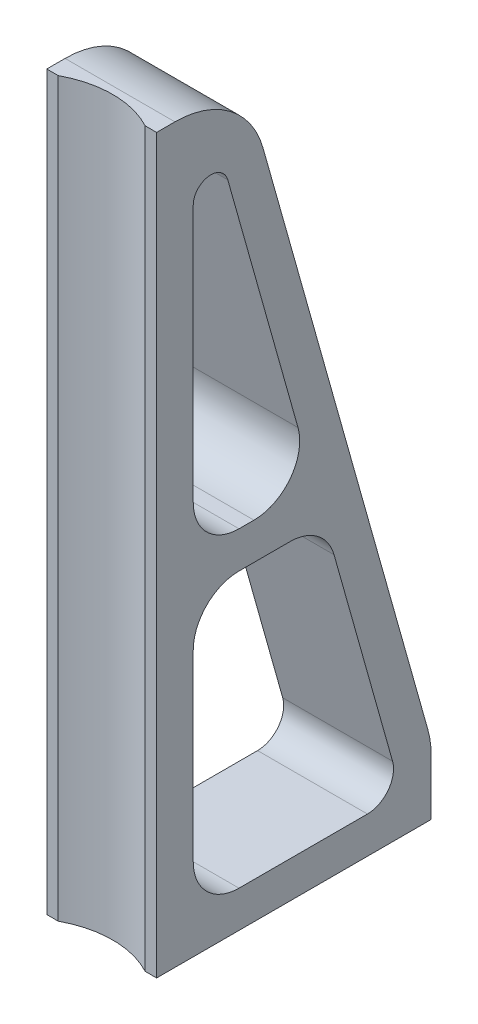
ISO-10303-21;
HEADER;
FILE_DESCRIPTION(('STEP AP214'),'2;1');
FILE_NAME('part.step','',(''),(''),'','','');
FILE_SCHEMA(('AUTOMOTIVE_DESIGN { 1 0 10303 214 1 1 1 1 }'));
ENDSEC;
DATA;
#1=APPLICATION_CONTEXT('core data for automotive mechanical design processes');
#2=APPLICATION_PROTOCOL_DEFINITION('international standard','automotive_design',2000,#1);
#3=PRODUCT_CONTEXT('',#1,'mechanical');
#4=PRODUCT('Part','Part','',(#3));
#5=PRODUCT_RELATED_PRODUCT_CATEGORY('part','',(#4));
#6=PRODUCT_DEFINITION_FORMATION('','',#4);
#7=PRODUCT_DEFINITION_CONTEXT('part definition',#1,'design');
#8=PRODUCT_DEFINITION('design','',#6,#7);
#9=PRODUCT_DEFINITION_SHAPE('','',#8);
#10=(LENGTH_UNIT() NAMED_UNIT(*) SI_UNIT(.MILLI.,.METRE.));
#11=(NAMED_UNIT(*) PLANE_ANGLE_UNIT() SI_UNIT($,.RADIAN.));
#12=(NAMED_UNIT(*) SI_UNIT($,.STERADIAN.) SOLID_ANGLE_UNIT());
#13=UNCERTAINTY_MEASURE_WITH_UNIT(LENGTH_MEASURE(1.E-05),#10,'distance_accuracy_value','');
#14=(GEOMETRIC_REPRESENTATION_CONTEXT(3) GLOBAL_UNCERTAINTY_ASSIGNED_CONTEXT((#13)) GLOBAL_UNIT_ASSIGNED_CONTEXT((#10,
#11,#12)) REPRESENTATION_CONTEXT('',''));
#15=CARTESIAN_POINT('',(0.,0.,0.));
#16=DIRECTION('',(0.,0.,1.));
#17=DIRECTION('',(1.,0.,0.));
#18=AXIS2_PLACEMENT_3D('',#15,#16,#17);
#19=CARTESIAN_POINT('',(3.81,0.,0.));
#20=DIRECTION('',(0.,0.,-1.));
#21=DIRECTION('',(-1.,0.,0.));
#22=AXIS2_PLACEMENT_3D('',#19,#20,#21);
#23=PLANE('',#22);
#24=DIRECTION('',(-1.,0.,0.));
#25=VECTOR('',#24,1.);
#26=CARTESIAN_POINT('',(3.81,0.,0.));
#27=LINE('',#26,#25);
#28=CARTESIAN_POINT('',(-3.01608289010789,0.,0.));
#29=VERTEX_POINT('',#28);
#30=CARTESIAN_POINT('',(-3.81,0.,0.));
#31=VERTEX_POINT('',#30);
#32=EDGE_CURVE('E275',#29,#31,#27,.T.);
#33=ORIENTED_EDGE('',*,*,#32,.F.);
#34=DIRECTION('',(0.,1.,0.));
#35=VECTOR('',#34,1.);
#36=CARTESIAN_POINT('',(-3.01608289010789,0.,0.));
#37=LINE('',#36,#35);
#38=CARTESIAN_POINT('',(-3.01608289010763,50.8,0.));
#39=VERTEX_POINT('',#38);
#40=EDGE_CURVE('E316',#29,#39,#37,.T.);
#41=ORIENTED_EDGE('',*,*,#40,.T.);
#42=DIRECTION('',(-1.,0.,0.));
#43=VECTOR('',#42,1.);
#44=CARTESIAN_POINT('',(3.81,50.8,0.));
#45=LINE('',#44,#43);
#46=CARTESIAN_POINT('',(-3.81,50.8,0.));
#47=VERTEX_POINT('',#46);
#48=EDGE_CURVE('E294',#39,#47,#45,.T.);
#49=ORIENTED_EDGE('',*,*,#48,.T.);
#50=DIRECTION('',(0.,-1.,0.));
#51=VECTOR('',#50,1.);
#52=CARTESIAN_POINT('',(-3.81,0.,0.));
#53=LINE('',#52,#51);
#54=EDGE_CURVE('E263',#47,#31,#53,.T.);
#55=ORIENTED_EDGE('',*,*,#54,.T.);
#56=EDGE_LOOP('',(#33,#41,#49,#55));
#57=FACE_BOUND('',#56,.T.);
#58=ADVANCED_FACE('F33',(#57),#23,.F.);
#59=CARTESIAN_POINT('',(3.81,0.,-19.05));
#60=DIRECTION('',(0.,1.,0.));
#61=DIRECTION('',(0.,0.,1.));
#62=AXIS2_PLACEMENT_3D('',#59,#60,#61);
#63=PLANE('',#62);
#64=CARTESIAN_POINT('',(3.81,0.,0.));
#65=VERTEX_POINT('',#64);
#66=CARTESIAN_POINT('',(3.01608289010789,0.,0.));
#67=VERTEX_POINT('',#66);
#68=EDGE_CURVE('E291',#65,#67,#27,.T.);
#69=ORIENTED_EDGE('',*,*,#68,.T.);
#70=CARTESIAN_POINT('',(0.,0.,5.58799999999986));
#71=DIRECTION('',(0.,1.,0.));
#72=DIRECTION('',(0.,0.,1.));
#73=AXIS2_PLACEMENT_3D('',#70,#71,#72);
#74=CIRCLE('',#73,6.35);
#75=EDGE_CURVE('E254',#67,#29,#74,.T.);
#76=ORIENTED_EDGE('',*,*,#75,.T.);
#77=ORIENTED_EDGE('',*,*,#32,.T.);
#78=DIRECTION('',(0.,0.,-1.));
#79=VECTOR('',#78,1.);
#80=CARTESIAN_POINT('',(-3.81,0.,-19.05));
#81=LINE('',#80,#79);
#82=CARTESIAN_POINT('',(-3.81,0.,-19.05));
#83=VERTEX_POINT('',#82);
#84=EDGE_CURVE('E257',#31,#83,#81,.T.);
#85=ORIENTED_EDGE('',*,*,#84,.T.);
#86=DIRECTION('',(-1.,0.,0.));
#87=VECTOR('',#86,1.);
#88=CARTESIAN_POINT('',(3.81,0.,-19.05));
#89=LINE('',#88,#87);
#90=CARTESIAN_POINT('',(3.81,0.,-19.05));
#91=VERTEX_POINT('',#90);
#92=EDGE_CURVE('E310',#91,#83,#89,.T.);
#93=ORIENTED_EDGE('',*,*,#92,.F.);
#94=DIRECTION('',(0.,0.,-1.));
#95=VECTOR('',#94,1.);
#96=CARTESIAN_POINT('',(3.81,0.,-19.05));
#97=LINE('',#96,#95);
#98=EDGE_CURVE('E259',#65,#91,#97,.T.);
#99=ORIENTED_EDGE('',*,*,#98,.F.);
#100=EDGE_LOOP('',(#69,#76,#77,#85,#93,#99));
#101=FACE_BOUND('',#100,.T.);
#102=ADVANCED_FACE('F374',(#101),#63,.F.);
#103=CARTESIAN_POINT('',(3.81,3.81,-19.05));
#104=DIRECTION('',(0.,0.,1.));
#105=DIRECTION('',(1.,0.,0.));
#106=AXIS2_PLACEMENT_3D('',#103,#104,#105);
#107=PLANE('',#106);
#108=DIRECTION('',(0.,1.,0.));
#109=VECTOR('',#108,1.);
#110=CARTESIAN_POINT('',(-3.81,3.81,-19.05));
#111=LINE('',#110,#109);
#112=CARTESIAN_POINT('',(-3.81,3.81,-19.05));
#113=VERTEX_POINT('',#112);
#114=EDGE_CURVE('E278',#83,#113,#111,.T.);
#115=ORIENTED_EDGE('',*,*,#114,.T.);
#116=DIRECTION('',(-1.,0.,0.));
#117=VECTOR('',#116,1.);
#118=CARTESIAN_POINT('',(3.81,3.81,-19.05));
#119=LINE('',#118,#117);
#120=CARTESIAN_POINT('',(3.81,3.81,-19.05));
#121=VERTEX_POINT('',#120);
#122=EDGE_CURVE('E307',#121,#113,#119,.T.);
#123=ORIENTED_EDGE('',*,*,#122,.F.);
#124=DIRECTION('',(0.,1.,0.));
#125=VECTOR('',#124,1.);
#126=CARTESIAN_POINT('',(3.81,3.81,-19.05));
#127=LINE('',#126,#125);
#128=EDGE_CURVE('E262',#91,#121,#127,.T.);
#129=ORIENTED_EDGE('',*,*,#128,.F.);
#130=ORIENTED_EDGE('',*,*,#92,.T.);
#131=EDGE_LOOP('',(#115,#123,#129,#130));
#132=FACE_BOUND('',#131,.T.);
#133=ADVANCED_FACE('F381',(#132),#107,.F.);
#134=CARTESIAN_POINT('',(3.81,3.81,-12.7));
#135=DIRECTION('',(-1.,0.,0.));
#136=DIRECTION('',(0.,0.,1.));
#137=AXIS2_PLACEMENT_3D('',#134,#135,#136);
#138=CYLINDRICAL_SURFACE('',#137,6.35);
#139=CARTESIAN_POINT('',(-3.81,3.81,-12.7));
#140=DIRECTION('',(1.,0.,0.));
#141=DIRECTION('',(0.,0.,-1.));
#142=AXIS2_PLACEMENT_3D('',#139,#140,#141);
#143=CIRCLE('',#142,6.35);
#144=CARTESIAN_POINT('',(-3.81,5.5292344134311,-18.8128334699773));
#145=VERTEX_POINT('',#144);
#146=EDGE_CURVE('E280',#113,#145,#143,.T.);
#147=ORIENTED_EDGE('',*,*,#146,.T.);
#148=DIRECTION('',(-1.,0.,0.));
#149=VECTOR('',#148,1.);
#150=CARTESIAN_POINT('',(3.81,5.5292344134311,-18.8128334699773));
#151=LINE('',#150,#149);
#152=CARTESIAN_POINT('',(3.81,5.5292344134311,-18.8128334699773));
#153=VERTEX_POINT('',#152);
#154=EDGE_CURVE('E304',#153,#145,#151,.T.);
#155=ORIENTED_EDGE('',*,*,#154,.F.);
#156=CARTESIAN_POINT('',(3.81,3.81,-12.7));
#157=DIRECTION('',(1.,0.,0.));
#158=DIRECTION('',(0.,0.,-1.));
#159=AXIS2_PLACEMENT_3D('',#156,#157,#158);
#160=CIRCLE('',#159,6.35);
#161=EDGE_CURVE('E265',#121,#153,#160,.T.);
#162=ORIENTED_EDGE('',*,*,#161,.F.);
#163=ORIENTED_EDGE('',*,*,#122,.T.);
#164=EDGE_LOOP('',(#147,#155,#162,#163));
#165=FACE_BOUND('',#164,.T.);
#166=ADVANCED_FACE('F425',(#165),#138,.T.);
#167=CARTESIAN_POINT('',(3.81,46.1692344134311,-7.38283346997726));
#168=DIRECTION('',(0.,-0.270745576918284,0.962650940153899));
#169=DIRECTION('',(0.,-0.962650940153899,-0.270745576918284));
#170=AXIS2_PLACEMENT_3D('',#167,#168,#169);
#171=PLANE('',#170);
#172=DIRECTION('',(0.,0.962650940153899,0.270745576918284));
#173=VECTOR('',#172,1.);
#174=CARTESIAN_POINT('',(-3.81,46.1692344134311,-7.38283346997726));
#175=LINE('',#174,#173);
#176=CARTESIAN_POINT('',(-3.81,46.1692344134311,-7.38283346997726));
#177=VERTEX_POINT('',#176);
#178=EDGE_CURVE('E282',#145,#177,#175,.T.);
#179=ORIENTED_EDGE('',*,*,#178,.T.);
#180=DIRECTION('',(-1.,0.,0.));
#181=VECTOR('',#180,1.);
#182=CARTESIAN_POINT('',(3.81,46.1692344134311,-7.38283346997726));
#183=LINE('',#182,#181);
#184=CARTESIAN_POINT('',(3.81,46.1692344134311,-7.38283346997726));
#185=VERTEX_POINT('',#184);
#186=EDGE_CURVE('E301',#185,#177,#183,.T.);
#187=ORIENTED_EDGE('',*,*,#186,.F.);
#188=DIRECTION('',(0.,0.962650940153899,0.270745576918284));
#189=VECTOR('',#188,1.);
#190=CARTESIAN_POINT('',(3.81,46.1692344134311,-7.38283346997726));
#191=LINE('',#190,#189);
#192=EDGE_CURVE('E267',#153,#185,#191,.T.);
#193=ORIENTED_EDGE('',*,*,#192,.F.);
#194=ORIENTED_EDGE('',*,*,#154,.T.);
#195=EDGE_LOOP('',(#179,#187,#193,#194));
#196=FACE_BOUND('',#195,.T.);
#197=ADVANCED_FACE('F427',(#196),#171,.F.);
#198=CARTESIAN_POINT('',(3.81,44.45,-1.27));
#199=DIRECTION('',(-1.,0.,0.));
#200=DIRECTION('',(0.,0.,1.));
#201=AXIS2_PLACEMENT_3D('',#198,#199,#200);
#202=CYLINDRICAL_SURFACE('',#201,6.35);
#203=CARTESIAN_POINT('',(-3.81,44.45,-1.27));
#204=DIRECTION('',(1.,0.,0.));
#205=DIRECTION('',(0.,0.,1.));
#206=AXIS2_PLACEMENT_3D('',#203,#204,#205);
#207=CIRCLE('',#206,6.35);
#208=CARTESIAN_POINT('',(-3.81,50.8,-1.27));
#209=VERTEX_POINT('',#208);
#210=EDGE_CURVE('E284',#177,#209,#207,.T.);
#211=ORIENTED_EDGE('',*,*,#210,.T.);
#212=DIRECTION('',(-1.,0.,0.));
#213=VECTOR('',#212,1.);
#214=CARTESIAN_POINT('',(3.81,50.8,-1.27));
#215=LINE('',#214,#213);
#216=CARTESIAN_POINT('',(3.81,50.8,-1.27));
#217=VERTEX_POINT('',#216);
#218=EDGE_CURVE('E298',#217,#209,#215,.T.);
#219=ORIENTED_EDGE('',*,*,#218,.F.);
#220=CARTESIAN_POINT('',(3.81,44.45,-1.27));
#221=DIRECTION('',(1.,0.,0.));
#222=DIRECTION('',(0.,0.,1.));
#223=AXIS2_PLACEMENT_3D('',#220,#221,#222);
#224=CIRCLE('',#223,6.35);
#225=EDGE_CURVE('E269',#185,#217,#224,.T.);
#226=ORIENTED_EDGE('',*,*,#225,.F.);
#227=ORIENTED_EDGE('',*,*,#186,.T.);
#228=EDGE_LOOP('',(#211,#219,#226,#227));
#229=FACE_BOUND('',#228,.T.);
#230=ADVANCED_FACE('F395',(#229),#202,.T.);
#231=CARTESIAN_POINT('',(3.81,50.8,0.));
#232=DIRECTION('',(0.,-1.,0.));
#233=DIRECTION('',(0.,0.,-1.));
#234=AXIS2_PLACEMENT_3D('',#231,#232,#233);
#235=PLANE('',#234);
#236=ORIENTED_EDGE('',*,*,#48,.F.);
#237=CARTESIAN_POINT('',(0.,50.8,5.588));
#238=DIRECTION('',(0.,1.,0.));
#239=DIRECTION('',(0.,0.,1.));
#240=AXIS2_PLACEMENT_3D('',#237,#238,#239);
#241=CIRCLE('',#240,6.35);
#242=CARTESIAN_POINT('',(3.01608289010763,50.8,0.));
#243=VERTEX_POINT('',#242);
#244=EDGE_CURVE('E251',#243,#39,#241,.T.);
#245=ORIENTED_EDGE('',*,*,#244,.F.);
#246=CARTESIAN_POINT('',(3.81,50.8,0.));
#247=VERTEX_POINT('',#246);
#248=EDGE_CURVE('E295',#247,#243,#45,.T.);
#249=ORIENTED_EDGE('',*,*,#248,.F.);
#250=DIRECTION('',(0.,0.,1.));
#251=VECTOR('',#250,1.);
#252=CARTESIAN_POINT('',(3.81,50.8,0.));
#253=LINE('',#252,#251);
#254=EDGE_CURVE('E271',#217,#247,#253,.T.);
#255=ORIENTED_EDGE('',*,*,#254,.F.);
#256=ORIENTED_EDGE('',*,*,#218,.T.);
#257=DIRECTION('',(0.,0.,1.));
#258=VECTOR('',#257,1.);
#259=CARTESIAN_POINT('',(-3.81,50.8,0.));
#260=LINE('',#259,#258);
#261=EDGE_CURVE('E286',#209,#47,#260,.T.);
#262=ORIENTED_EDGE('',*,*,#261,.T.);
#263=EDGE_LOOP('',(#236,#245,#249,#255,#256,#262));
#264=FACE_BOUND('',#263,.T.);
#265=ADVANCED_FACE('F388',(#264),#235,.F.);
#266=ORIENTED_EDGE('',*,*,#248,.T.);
#267=DIRECTION('',(0.,1.,0.));
#268=VECTOR('',#267,1.);
#269=CARTESIAN_POINT('',(3.01608289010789,0.,0.));
#270=LINE('',#269,#268);
#271=EDGE_CURVE('E313',#243,#67,#270,.F.);
#272=ORIENTED_EDGE('',*,*,#271,.T.);
#273=ORIENTED_EDGE('',*,*,#68,.F.);
#274=DIRECTION('',(0.,-1.,0.));
#275=VECTOR('',#274,1.);
#276=CARTESIAN_POINT('',(3.81,0.,0.));
#277=LINE('',#276,#275);
#278=EDGE_CURVE('E273',#247,#65,#277,.T.);
#279=ORIENTED_EDGE('',*,*,#278,.F.);
#280=EDGE_LOOP('',(#266,#272,#273,#279));
#281=FACE_BOUND('',#280,.T.);
#282=ADVANCED_FACE('F377',(#281),#23,.F.);
#283=CARTESIAN_POINT('',(3.81,44.45,-1.27));
#284=DIRECTION('',(-1.,0.,0.));
#285=DIRECTION('',(0.,0.,1.));
#286=AXIS2_PLACEMENT_3D('',#283,#284,#285);
#287=PLANE('',#286);
#288=DIRECTION('',(0.,-1.,0.));
#289=VECTOR('',#288,1.);
#290=CARTESIAN_POINT('',(3.81,21.59,-2.54));
#291=LINE('',#290,#289);
#292=CARTESIAN_POINT('',(3.81,18.415,-2.54));
#293=VERTEX_POINT('',#292);
#294=CARTESIAN_POINT('',(3.81,5.71500000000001,-2.54));
#295=VERTEX_POINT('',#294);
#296=EDGE_CURVE('E215',#293,#295,#291,.T.);
#297=ORIENTED_EDGE('',*,*,#296,.F.);
#298=CARTESIAN_POINT('',(3.81,18.415,-5.715));
#299=DIRECTION('',(-1.,0.,0.));
#300=DIRECTION('',(0.,0.,1.));
#301=AXIS2_PLACEMENT_3D('',#298,#299,#300);
#302=CIRCLE('',#301,3.175);
#303=CARTESIAN_POINT('',(3.81,21.59,-5.715));
#304=VERTEX_POINT('',#303);
#305=EDGE_CURVE('E347',#293,#304,#302,.T.);
#306=ORIENTED_EDGE('',*,*,#305,.T.);
#307=DIRECTION('',(0.,0.,1.));
#308=VECTOR('',#307,1.);
#309=CARTESIAN_POINT('',(3.81,21.59,-2.54));
#310=LINE('',#309,#308);
#311=CARTESIAN_POINT('',(3.81,21.59,-9.25198056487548));
#312=VERTEX_POINT('',#311);
#313=EDGE_CURVE('E212',#312,#304,#310,.T.);
#314=ORIENTED_EDGE('',*,*,#313,.F.);
#315=CARTESIAN_POINT('',(3.81,18.415,-9.25198056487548));
#316=DIRECTION('',(-1.,0.,0.));
#317=DIRECTION('',(0.,0.,1.));
#318=AXIS2_PLACEMENT_3D('',#315,#316,#317);
#319=CIRCLE('',#318,3.175);
#320=CARTESIAN_POINT('',(3.81,19.2746172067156,-12.3083972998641));
#321=VERTEX_POINT('',#320);
#322=EDGE_CURVE('E343',#312,#321,#319,.T.);
#323=ORIENTED_EDGE('',*,*,#322,.T.);
#324=DIRECTION('',(0.,0.962650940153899,0.270745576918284));
#325=VECTOR('',#324,1.);
#326=CARTESIAN_POINT('',(3.81,4.84154064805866,-16.3677000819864));
#327=LINE('',#326,#325);
#328=CARTESIAN_POINT('',(3.81,4.84154064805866,-16.3677000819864));
#329=VERTEX_POINT('',#328);
#330=EDGE_CURVE('E221',#329,#321,#327,.T.);
#331=ORIENTED_EDGE('',*,*,#330,.F.);
#332=CARTESIAN_POINT('',(3.81,4.35117344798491,-14.6241722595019));
#333=DIRECTION('',(1.,0.,0.));
#334=DIRECTION('',(0.,0.,-1.));
#335=AXIS2_PLACEMENT_3D('',#332,#333,#334);
#336=CIRCLE('',#335,1.81117344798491);
#337=CARTESIAN_POINT('',(3.81,2.54,-14.6241722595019));
#338=VERTEX_POINT('',#337);
#339=EDGE_CURVE('E219',#338,#329,#336,.T.);
#340=ORIENTED_EDGE('',*,*,#339,.F.);
#341=DIRECTION('',(0.,0.,-1.));
#342=VECTOR('',#341,1.);
#343=CARTESIAN_POINT('',(3.81,2.54,-2.54));
#344=LINE('',#343,#342);
#345=CARTESIAN_POINT('',(3.81,2.54,-5.715));
#346=VERTEX_POINT('',#345);
#347=EDGE_CURVE('E199',#346,#338,#344,.T.);
#348=ORIENTED_EDGE('',*,*,#347,.F.);
#349=CARTESIAN_POINT('',(3.81,5.715,-5.715));
#350=DIRECTION('',(-1.,0.,0.));
#351=DIRECTION('',(0.,0.,1.));
#352=AXIS2_PLACEMENT_3D('',#349,#350,#351);
#353=CIRCLE('',#352,3.175);
#354=EDGE_CURVE('E41',#346,#295,#353,.T.);
#355=ORIENTED_EDGE('',*,*,#354,.T.);
#356=EDGE_LOOP('',(#297,#306,#314,#323,#331,#340,#348,#355));
#357=FACE_BOUND('',#356,.T.);
#358=DIRECTION('',(0.,0.,-1.));
#359=VECTOR('',#358,1.);
#360=CARTESIAN_POINT('',(3.81,24.13,-2.54));
#361=LINE('',#360,#359);
#362=CARTESIAN_POINT('',(3.81,24.13,-5.715));
#363=VERTEX_POINT('',#362);
#364=CARTESIAN_POINT('',(3.81,24.13,-6.75166806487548));
#365=VERTEX_POINT('',#364);
#366=EDGE_CURVE('E242',#363,#365,#361,.T.);
#367=ORIENTED_EDGE('',*,*,#366,.F.);
#368=CARTESIAN_POINT('',(3.81,27.305,-5.715));
#369=DIRECTION('',(-1.,0.,0.));
#370=DIRECTION('',(0.,0.,1.));
#371=AXIS2_PLACEMENT_3D('',#368,#369,#370);
#372=CIRCLE('',#371,3.175);
#373=CARTESIAN_POINT('',(3.81,27.305,-2.54));
#374=VERTEX_POINT('',#373);
#375=EDGE_CURVE('E355',#363,#374,#372,.T.);
#376=ORIENTED_EDGE('',*,*,#375,.T.);
#377=DIRECTION('',(0.,-1.,0.));
#378=VECTOR('',#377,1.);
#379=CARTESIAN_POINT('',(3.81,45.1507805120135,-2.54));
#380=LINE('',#379,#378);
#381=CARTESIAN_POINT('',(3.81,45.1507805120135,-2.54));
#382=VERTEX_POINT('',#381);
#383=EDGE_CURVE('E225',#382,#374,#380,.T.);
#384=ORIENTED_EDGE('',*,*,#383,.F.);
#385=CARTESIAN_POINT('',(3.81,45.1507805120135,-3.76166404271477));
#386=DIRECTION('',(1.,0.,0.));
#387=DIRECTION('',(0.,0.,-1.));
#388=AXIS2_PLACEMENT_3D('',#385,#386,#387);
#389=CIRCLE('',#388,1.22166404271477);
#390=CARTESIAN_POINT('',(3.81,45.4815406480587,-4.93770008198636));
#391=VERTEX_POINT('',#390);
#392=EDGE_CURVE('E231',#391,#382,#389,.T.);
#393=ORIENTED_EDGE('',*,*,#392,.F.);
#394=DIRECTION('',(0.,0.962650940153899,0.270745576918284));
#395=VECTOR('',#394,1.);
#396=CARTESIAN_POINT('',(3.81,24.13,-10.9428208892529));
#397=LINE('',#396,#395);
#398=CARTESIAN_POINT('',(3.81,28.1646172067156,-9.80808479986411));
#399=VERTEX_POINT('',#398);
#400=EDGE_CURVE('E245',#399,#391,#397,.T.);
#401=ORIENTED_EDGE('',*,*,#400,.F.);
#402=CARTESIAN_POINT('',(3.81,27.305,-6.75166806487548));
#403=DIRECTION('',(-1.,0.,0.));
#404=DIRECTION('',(0.,0.,1.));
#405=AXIS2_PLACEMENT_3D('',#402,#403,#404);
#406=CIRCLE('',#405,3.175);
#407=EDGE_CURVE('E351',#399,#365,#406,.T.);
#408=ORIENTED_EDGE('',*,*,#407,.T.);
#409=EDGE_LOOP('',(#367,#376,#384,#393,#401,#408));
#410=FACE_BOUND('',#409,.T.);
#411=ORIENTED_EDGE('',*,*,#98,.T.);
#412=ORIENTED_EDGE('',*,*,#128,.T.);
#413=ORIENTED_EDGE('',*,*,#161,.T.);
#414=ORIENTED_EDGE('',*,*,#192,.T.);
#415=ORIENTED_EDGE('',*,*,#225,.T.);
#416=ORIENTED_EDGE('',*,*,#254,.T.);
#417=ORIENTED_EDGE('',*,*,#278,.T.);
#418=EDGE_LOOP('',(#411,#412,#413,#414,#415,#416,#417));
#419=FACE_BOUND('',#418,.T.);
#420=ADVANCED_FACE('F360',(#357,#410,#419),#287,.F.);
#421=CARTESIAN_POINT('',(-3.81,44.45,-1.27));
#422=DIRECTION('',(-1.,0.,0.));
#423=DIRECTION('',(0.,0.,1.));
#424=AXIS2_PLACEMENT_3D('',#421,#422,#423);
#425=PLANE('',#424);
#426=DIRECTION('',(0.,0.962650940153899,0.270745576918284));
#427=VECTOR('',#426,1.);
#428=CARTESIAN_POINT('',(-3.81,4.84154064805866,-16.3677000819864));
#429=LINE('',#428,#427);
#430=CARTESIAN_POINT('',(-3.81,4.84154064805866,-16.3677000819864));
#431=VERTEX_POINT('',#430);
#432=CARTESIAN_POINT('',(-3.81,19.2746172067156,-12.3083972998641));
#433=VERTEX_POINT('',#432);
#434=EDGE_CURVE('E204',#431,#433,#429,.T.);
#435=ORIENTED_EDGE('',*,*,#434,.T.);
#436=CARTESIAN_POINT('',(-3.81,18.415,-9.25198056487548));
#437=DIRECTION('',(-1.,0.,0.));
#438=DIRECTION('',(0.,0.,1.));
#439=AXIS2_PLACEMENT_3D('',#436,#437,#438);
#440=CIRCLE('',#439,3.175);
#441=CARTESIAN_POINT('',(-3.81,21.59,-9.25198056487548));
#442=VERTEX_POINT('',#441);
#443=EDGE_CURVE('E345',#433,#442,#440,.F.);
#444=ORIENTED_EDGE('',*,*,#443,.T.);
#445=DIRECTION('',(0.,0.,1.));
#446=VECTOR('',#445,1.);
#447=CARTESIAN_POINT('',(-3.81,21.59,-2.54));
#448=LINE('',#447,#446);
#449=CARTESIAN_POINT('',(-3.81,21.59,-5.715));
#450=VERTEX_POINT('',#449);
#451=EDGE_CURVE('E224',#442,#450,#448,.T.);
#452=ORIENTED_EDGE('',*,*,#451,.T.);
#453=CARTESIAN_POINT('',(-3.81,18.415,-5.715));
#454=DIRECTION('',(-1.,0.,0.));
#455=DIRECTION('',(0.,0.,1.));
#456=AXIS2_PLACEMENT_3D('',#453,#454,#455);
#457=CIRCLE('',#456,3.175);
#458=CARTESIAN_POINT('',(-3.81,18.415,-2.54));
#459=VERTEX_POINT('',#458);
#460=EDGE_CURVE('E349',#450,#459,#457,.F.);
#461=ORIENTED_EDGE('',*,*,#460,.T.);
#462=DIRECTION('',(0.,-1.,0.));
#463=VECTOR('',#462,1.);
#464=CARTESIAN_POINT('',(-3.81,21.59,-2.54));
#465=LINE('',#464,#463);
#466=CARTESIAN_POINT('',(-3.81,5.71500000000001,-2.54));
#467=VERTEX_POINT('',#466);
#468=EDGE_CURVE('E193',#459,#467,#465,.T.);
#469=ORIENTED_EDGE('',*,*,#468,.T.);
#470=CARTESIAN_POINT('',(-3.81,5.715,-5.715));
#471=DIRECTION('',(-1.,0.,0.));
#472=DIRECTION('',(0.,0.,1.));
#473=AXIS2_PLACEMENT_3D('',#470,#471,#472);
#474=CIRCLE('',#473,3.175);
#475=CARTESIAN_POINT('',(-3.81,2.54,-5.715));
#476=VERTEX_POINT('',#475);
#477=EDGE_CURVE('E11',#467,#476,#474,.F.);
#478=ORIENTED_EDGE('',*,*,#477,.T.);
#479=DIRECTION('',(0.,0.,-1.));
#480=VECTOR('',#479,1.);
#481=CARTESIAN_POINT('',(-3.81,2.54,-2.54));
#482=LINE('',#481,#480);
#483=CARTESIAN_POINT('',(-3.81,2.54,-14.6241722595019));
#484=VERTEX_POINT('',#483);
#485=EDGE_CURVE('E185',#476,#484,#482,.T.);
#486=ORIENTED_EDGE('',*,*,#485,.T.);
#487=CARTESIAN_POINT('',(-3.81,4.35117344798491,-14.6241722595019));
#488=DIRECTION('',(1.,0.,0.));
#489=DIRECTION('',(0.,0.,-1.));
#490=AXIS2_PLACEMENT_3D('',#487,#488,#489);
#491=CIRCLE('',#490,1.81117344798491);
#492=EDGE_CURVE('E191',#484,#431,#491,.T.);
#493=ORIENTED_EDGE('',*,*,#492,.T.);
#494=EDGE_LOOP('',(#435,#444,#452,#461,#469,#478,#486,#493));
#495=FACE_BOUND('',#494,.T.);
#496=DIRECTION('',(0.,-1.,0.));
#497=VECTOR('',#496,1.);
#498=CARTESIAN_POINT('',(-3.81,45.1507805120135,-2.54));
#499=LINE('',#498,#497);
#500=CARTESIAN_POINT('',(-3.81,45.1507805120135,-2.54));
#501=VERTEX_POINT('',#500);
#502=CARTESIAN_POINT('',(-3.81,27.305,-2.54));
#503=VERTEX_POINT('',#502);
#504=EDGE_CURVE('E227',#501,#503,#499,.T.);
#505=ORIENTED_EDGE('',*,*,#504,.T.);
#506=CARTESIAN_POINT('',(-3.81,27.305,-5.715));
#507=DIRECTION('',(-1.,0.,0.));
#508=DIRECTION('',(0.,0.,1.));
#509=AXIS2_PLACEMENT_3D('',#506,#507,#508);
#510=CIRCLE('',#509,3.175);
#511=CARTESIAN_POINT('',(-3.81,24.13,-5.715));
#512=VERTEX_POINT('',#511);
#513=EDGE_CURVE('E357',#503,#512,#510,.F.);
#514=ORIENTED_EDGE('',*,*,#513,.T.);
#515=DIRECTION('',(0.,0.,-1.));
#516=VECTOR('',#515,1.);
#517=CARTESIAN_POINT('',(-3.81,24.13,-2.54));
#518=LINE('',#517,#516);
#519=CARTESIAN_POINT('',(-3.81,24.13,-6.75166806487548));
#520=VERTEX_POINT('',#519);
#521=EDGE_CURVE('E230',#512,#520,#518,.T.);
#522=ORIENTED_EDGE('',*,*,#521,.T.);
#523=CARTESIAN_POINT('',(-3.81,27.305,-6.75166806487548));
#524=DIRECTION('',(-1.,0.,0.));
#525=DIRECTION('',(0.,0.,1.));
#526=AXIS2_PLACEMENT_3D('',#523,#524,#525);
#527=CIRCLE('',#526,3.175);
#528=CARTESIAN_POINT('',(-3.81,28.1646172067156,-9.80808479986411));
#529=VERTEX_POINT('',#528);
#530=EDGE_CURVE('E353',#520,#529,#527,.F.);
#531=ORIENTED_EDGE('',*,*,#530,.T.);
#532=DIRECTION('',(0.,0.962650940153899,0.270745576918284));
#533=VECTOR('',#532,1.);
#534=CARTESIAN_POINT('',(-3.81,24.13,-10.9428208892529));
#535=LINE('',#534,#533);
#536=CARTESIAN_POINT('',(-3.81,45.4815406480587,-4.93770008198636));
#537=VERTEX_POINT('',#536);
#538=EDGE_CURVE('E234',#529,#537,#535,.T.);
#539=ORIENTED_EDGE('',*,*,#538,.T.);
#540=CARTESIAN_POINT('',(-3.81,45.1507805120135,-3.76166404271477));
#541=DIRECTION('',(1.,0.,0.));
#542=DIRECTION('',(0.,0.,-1.));
#543=AXIS2_PLACEMENT_3D('',#540,#541,#542);
#544=CIRCLE('',#543,1.22166404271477);
#545=EDGE_CURVE('E236',#537,#501,#544,.T.);
#546=ORIENTED_EDGE('',*,*,#545,.T.);
#547=EDGE_LOOP('',(#505,#514,#522,#531,#539,#546));
#548=FACE_BOUND('',#547,.T.);
#549=ORIENTED_EDGE('',*,*,#84,.F.);
#550=ORIENTED_EDGE('',*,*,#54,.F.);
#551=ORIENTED_EDGE('',*,*,#261,.F.);
#552=ORIENTED_EDGE('',*,*,#210,.F.);
#553=ORIENTED_EDGE('',*,*,#178,.F.);
#554=ORIENTED_EDGE('',*,*,#146,.F.);
#555=ORIENTED_EDGE('',*,*,#114,.F.);
#556=EDGE_LOOP('',(#549,#550,#551,#552,#553,#554,#555));
#557=FACE_BOUND('',#556,.T.);
#558=ADVANCED_FACE('F188',(#495,#548,#557),#425,.T.);
#559=CARTESIAN_POINT('',(0.,0.,5.58799999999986));
#560=DIRECTION('',(0.,1.,0.));
#561=DIRECTION('',(0.,0.,1.));
#562=AXIS2_PLACEMENT_3D('',#559,#560,#561);
#563=CYLINDRICAL_SURFACE('',#562,6.35);
#564=ORIENTED_EDGE('',*,*,#75,.F.);
#565=ORIENTED_EDGE('',*,*,#271,.F.);
#566=ORIENTED_EDGE('',*,*,#244,.T.);
#567=ORIENTED_EDGE('',*,*,#40,.F.);
#568=EDGE_LOOP('',(#564,#565,#566,#567));
#569=FACE_BOUND('',#568,.T.);
#570=ADVANCED_FACE('F404',(#569),#563,.F.);
#571=CARTESIAN_POINT('',(-3.81,45.1507805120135,-2.54));
#572=DIRECTION('',(0.,0.,1.));
#573=DIRECTION('',(1.,0.,0.));
#574=AXIS2_PLACEMENT_3D('',#571,#572,#573);
#575=PLANE('',#574);
#576=ORIENTED_EDGE('',*,*,#383,.T.);
#577=DIRECTION('',(1.,0.,0.));
#578=VECTOR('',#577,1.);
#579=CARTESIAN_POINT('',(-3.81,27.305,-2.54));
#580=LINE('',#579,#578);
#581=EDGE_CURVE('E339',#374,#503,#580,.F.);
#582=ORIENTED_EDGE('',*,*,#581,.T.);
#583=ORIENTED_EDGE('',*,*,#504,.F.);
#584=DIRECTION('',(1.,0.,0.));
#585=VECTOR('',#584,1.);
#586=CARTESIAN_POINT('',(-3.81,45.1507805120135,-2.54));
#587=LINE('',#586,#585);
#588=EDGE_CURVE('E249',#501,#382,#587,.T.);
#589=ORIENTED_EDGE('',*,*,#588,.T.);
#590=EDGE_LOOP('',(#576,#582,#583,#589));
#591=FACE_BOUND('',#590,.T.);
#592=ADVANCED_FACE('F473',(#591),#575,.F.);
#593=CARTESIAN_POINT('',(-3.81,45.1507805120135,-3.76166404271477));
#594=DIRECTION('',(1.,0.,0.));
#595=DIRECTION('',(0.,0.,-1.));
#596=AXIS2_PLACEMENT_3D('',#593,#594,#595);
#597=CYLINDRICAL_SURFACE('',#596,1.22166404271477);
#598=ORIENTED_EDGE('',*,*,#392,.T.);
#599=ORIENTED_EDGE('',*,*,#588,.F.);
#600=ORIENTED_EDGE('',*,*,#545,.F.);
#601=DIRECTION('',(1.,0.,0.));
#602=VECTOR('',#601,1.);
#603=CARTESIAN_POINT('',(-3.81,45.4815406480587,-4.93770008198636));
#604=LINE('',#603,#602);
#605=EDGE_CURVE('E239',#537,#391,#604,.T.);
#606=ORIENTED_EDGE('',*,*,#605,.T.);
#607=EDGE_LOOP('',(#598,#599,#600,#606));
#608=FACE_BOUND('',#607,.T.);
#609=ADVANCED_FACE('F463',(#608),#597,.F.);
#610=CARTESIAN_POINT('',(-3.81,24.13,-10.9428208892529));
#611=DIRECTION('',(0.,0.270745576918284,-0.962650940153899));
#612=DIRECTION('',(0.,0.962650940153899,0.270745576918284));
#613=AXIS2_PLACEMENT_3D('',#610,#611,#612);
#614=PLANE('',#613);
#615=ORIENTED_EDGE('',*,*,#538,.F.);
#616=DIRECTION('',(1.,0.,0.));
#617=VECTOR('',#616,1.);
#618=CARTESIAN_POINT('',(3.81,28.1646172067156,-9.80808479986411));
#619=LINE('',#618,#617);
#620=EDGE_CURVE('E331',#529,#399,#619,.T.);
#621=ORIENTED_EDGE('',*,*,#620,.T.);
#622=ORIENTED_EDGE('',*,*,#400,.T.);
#623=ORIENTED_EDGE('',*,*,#605,.F.);
#624=EDGE_LOOP('',(#615,#621,#622,#623));
#625=FACE_BOUND('',#624,.T.);
#626=ADVANCED_FACE('F458',(#625),#614,.F.);
#627=CARTESIAN_POINT('',(-3.81,24.13,-2.54));
#628=DIRECTION('',(0.,-1.,0.));
#629=DIRECTION('',(0.,0.,-1.));
#630=AXIS2_PLACEMENT_3D('',#627,#628,#629);
#631=PLANE('',#630);
#632=ORIENTED_EDGE('',*,*,#366,.T.);
#633=DIRECTION('',(1.,0.,0.));
#634=VECTOR('',#633,1.);
#635=CARTESIAN_POINT('',(-3.81,24.13,-6.75166806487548));
#636=LINE('',#635,#634);
#637=EDGE_CURVE('E337',#365,#520,#636,.F.);
#638=ORIENTED_EDGE('',*,*,#637,.T.);
#639=ORIENTED_EDGE('',*,*,#521,.F.);
#640=DIRECTION('',(1.,0.,0.));
#641=VECTOR('',#640,1.);
#642=CARTESIAN_POINT('',(3.81,24.13,-5.715));
#643=LINE('',#642,#641);
#644=EDGE_CURVE('E334',#512,#363,#643,.T.);
#645=ORIENTED_EDGE('',*,*,#644,.T.);
#646=EDGE_LOOP('',(#632,#638,#639,#645));
#647=FACE_BOUND('',#646,.T.);
#648=ADVANCED_FACE('F471',(#647),#631,.F.);
#649=CARTESIAN_POINT('',(-3.81,21.59,-2.54));
#650=DIRECTION('',(0.,1.,0.));
#651=DIRECTION('',(0.,0.,1.));
#652=AXIS2_PLACEMENT_3D('',#649,#650,#651);
#653=PLANE('',#652);
#654=ORIENTED_EDGE('',*,*,#451,.F.);
#655=DIRECTION('',(1.,0.,0.));
#656=VECTOR('',#655,1.);
#657=CARTESIAN_POINT('',(3.81,21.59,-9.25198056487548));
#658=LINE('',#657,#656);
#659=EDGE_CURVE('E321',#442,#312,#658,.T.);
#660=ORIENTED_EDGE('',*,*,#659,.T.);
#661=ORIENTED_EDGE('',*,*,#313,.T.);
#662=DIRECTION('',(1.,0.,0.));
#663=VECTOR('',#662,1.);
#664=CARTESIAN_POINT('',(-3.81,21.59,-5.715));
#665=LINE('',#664,#663);
#666=EDGE_CURVE('E319',#304,#450,#665,.F.);
#667=ORIENTED_EDGE('',*,*,#666,.T.);
#668=EDGE_LOOP('',(#654,#660,#661,#667));
#669=FACE_BOUND('',#668,.T.);
#670=ADVANCED_FACE('F611',(#669),#653,.F.);
#671=CARTESIAN_POINT('',(-3.81,4.84154064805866,-16.3677000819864));
#672=DIRECTION('',(0.,0.270745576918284,-0.962650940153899));
#673=DIRECTION('',(0.,0.962650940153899,0.270745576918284));
#674=AXIS2_PLACEMENT_3D('',#671,#672,#673);
#675=PLANE('',#674);
#676=ORIENTED_EDGE('',*,*,#330,.T.);
#677=DIRECTION('',(1.,0.,0.));
#678=VECTOR('',#677,1.);
#679=CARTESIAN_POINT('',(-3.81,19.2746172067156,-12.3083972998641));
#680=LINE('',#679,#678);
#681=EDGE_CURVE('E324',#321,#433,#680,.F.);
#682=ORIENTED_EDGE('',*,*,#681,.T.);
#683=ORIENTED_EDGE('',*,*,#434,.F.);
#684=DIRECTION('',(1.,0.,0.));
#685=VECTOR('',#684,1.);
#686=CARTESIAN_POINT('',(-3.81,4.84154064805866,-16.3677000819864));
#687=LINE('',#686,#685);
#688=EDGE_CURVE('E203',#431,#329,#687,.T.);
#689=ORIENTED_EDGE('',*,*,#688,.T.);
#690=EDGE_LOOP('',(#676,#682,#683,#689));
#691=FACE_BOUND('',#690,.T.);
#692=ADVANCED_FACE('F514',(#691),#675,.F.);
#693=CARTESIAN_POINT('',(-3.81,4.35117344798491,-14.6241722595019));
#694=DIRECTION('',(1.,0.,0.));
#695=DIRECTION('',(0.,0.,-1.));
#696=AXIS2_PLACEMENT_3D('',#693,#694,#695);
#697=CYLINDRICAL_SURFACE('',#696,1.81117344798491);
#698=ORIENTED_EDGE('',*,*,#339,.T.);
#699=ORIENTED_EDGE('',*,*,#688,.F.);
#700=ORIENTED_EDGE('',*,*,#492,.F.);
#701=DIRECTION('',(1.,0.,0.));
#702=VECTOR('',#701,1.);
#703=CARTESIAN_POINT('',(-3.81,2.54,-14.6241722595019));
#704=LINE('',#703,#702);
#705=EDGE_CURVE('E196',#484,#338,#704,.T.);
#706=ORIENTED_EDGE('',*,*,#705,.T.);
#707=EDGE_LOOP('',(#698,#699,#700,#706));
#708=FACE_BOUND('',#707,.T.);
#709=ADVANCED_FACE('F206',(#708),#697,.F.);
#710=CARTESIAN_POINT('',(-3.81,2.54,-2.54));
#711=DIRECTION('',(0.,-1.,0.));
#712=DIRECTION('',(0.,0.,-1.));
#713=AXIS2_PLACEMENT_3D('',#710,#711,#712);
#714=PLANE('',#713);
#715=ORIENTED_EDGE('',*,*,#485,.F.);
#716=DIRECTION('',(1.,0.,0.));
#717=VECTOR('',#716,1.);
#718=CARTESIAN_POINT('',(3.81,2.54,-5.715));
#719=LINE('',#718,#717);
#720=EDGE_CURVE('E341',#476,#346,#719,.T.);
#721=ORIENTED_EDGE('',*,*,#720,.T.);
#722=ORIENTED_EDGE('',*,*,#347,.T.);
#723=ORIENTED_EDGE('',*,*,#705,.F.);
#724=EDGE_LOOP('',(#715,#721,#722,#723));
#725=FACE_BOUND('',#724,.T.);
#726=ADVANCED_FACE('F197',(#725),#714,.F.);
#727=CARTESIAN_POINT('',(-3.81,21.59,-2.54));
#728=DIRECTION('',(0.,0.,1.));
#729=DIRECTION('',(1.,0.,0.));
#730=AXIS2_PLACEMENT_3D('',#727,#728,#729);
#731=PLANE('',#730);
#732=ORIENTED_EDGE('',*,*,#468,.F.);
#733=DIRECTION('',(1.,0.,0.));
#734=VECTOR('',#733,1.);
#735=CARTESIAN_POINT('',(3.81,18.415,-2.54));
#736=LINE('',#735,#734);
#737=EDGE_CURVE('E328',#459,#293,#736,.T.);
#738=ORIENTED_EDGE('',*,*,#737,.T.);
#739=ORIENTED_EDGE('',*,*,#296,.T.);
#740=DIRECTION('',(1.,0.,0.));
#741=VECTOR('',#740,1.);
#742=CARTESIAN_POINT('',(-3.81,5.715,-2.54));
#743=LINE('',#742,#741);
#744=EDGE_CURVE('E326',#295,#467,#743,.F.);
#745=ORIENTED_EDGE('',*,*,#744,.T.);
#746=EDGE_LOOP('',(#732,#738,#739,#745));
#747=FACE_BOUND('',#746,.T.);
#748=ADVANCED_FACE('F364',(#747),#731,.F.);
#749=CARTESIAN_POINT('',(-3.81,18.415,-9.25198056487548));
#750=DIRECTION('',(-1.,0.,0.));
#751=DIRECTION('',(0.,0.,1.));
#752=AXIS2_PLACEMENT_3D('',#749,#750,#751);
#753=CYLINDRICAL_SURFACE('',#752,3.175);
#754=ORIENTED_EDGE('',*,*,#443,.F.);
#755=ORIENTED_EDGE('',*,*,#681,.F.);
#756=ORIENTED_EDGE('',*,*,#322,.F.);
#757=ORIENTED_EDGE('',*,*,#659,.F.);
#758=EDGE_LOOP('',(#754,#755,#756,#757));
#759=FACE_BOUND('',#758,.T.);
#760=ADVANCED_FACE('F439',(#759),#753,.F.);
#761=CARTESIAN_POINT('',(-3.81,18.415,-5.715));
#762=DIRECTION('',(-1.,0.,0.));
#763=DIRECTION('',(0.,0.,1.));
#764=AXIS2_PLACEMENT_3D('',#761,#762,#763);
#765=CYLINDRICAL_SURFACE('',#764,3.175);
#766=ORIENTED_EDGE('',*,*,#460,.F.);
#767=ORIENTED_EDGE('',*,*,#666,.F.);
#768=ORIENTED_EDGE('',*,*,#305,.F.);
#769=ORIENTED_EDGE('',*,*,#737,.F.);
#770=EDGE_LOOP('',(#766,#767,#768,#769));
#771=FACE_BOUND('',#770,.T.);
#772=ADVANCED_FACE('F442',(#771),#765,.F.);
#773=CARTESIAN_POINT('',(-3.81,27.305,-6.75166806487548));
#774=DIRECTION('',(-1.,0.,0.));
#775=DIRECTION('',(0.,0.,1.));
#776=AXIS2_PLACEMENT_3D('',#773,#774,#775);
#777=CYLINDRICAL_SURFACE('',#776,3.175);
#778=ORIENTED_EDGE('',*,*,#530,.F.);
#779=ORIENTED_EDGE('',*,*,#637,.F.);
#780=ORIENTED_EDGE('',*,*,#407,.F.);
#781=ORIENTED_EDGE('',*,*,#620,.F.);
#782=EDGE_LOOP('',(#778,#779,#780,#781));
#783=FACE_BOUND('',#782,.T.);
#784=ADVANCED_FACE('F371',(#783),#777,.F.);
#785=CARTESIAN_POINT('',(-3.81,27.305,-5.715));
#786=DIRECTION('',(-1.,0.,0.));
#787=DIRECTION('',(0.,0.,1.));
#788=AXIS2_PLACEMENT_3D('',#785,#786,#787);
#789=CYLINDRICAL_SURFACE('',#788,3.175);
#790=ORIENTED_EDGE('',*,*,#513,.F.);
#791=ORIENTED_EDGE('',*,*,#581,.F.);
#792=ORIENTED_EDGE('',*,*,#375,.F.);
#793=ORIENTED_EDGE('',*,*,#644,.F.);
#794=EDGE_LOOP('',(#790,#791,#792,#793));
#795=FACE_BOUND('',#794,.T.);
#796=ADVANCED_FACE('F367',(#795),#789,.F.);
#797=CARTESIAN_POINT('',(-3.81,5.715,-5.715));
#798=DIRECTION('',(-1.,0.,0.));
#799=DIRECTION('',(0.,0.,1.));
#800=AXIS2_PLACEMENT_3D('',#797,#798,#799);
#801=CYLINDRICAL_SURFACE('',#800,3.175);
#802=ORIENTED_EDGE('',*,*,#477,.F.);
#803=ORIENTED_EDGE('',*,*,#744,.F.);
#804=ORIENTED_EDGE('',*,*,#354,.F.);
#805=ORIENTED_EDGE('',*,*,#720,.F.);
#806=EDGE_LOOP('',(#802,#803,#804,#805));
#807=FACE_BOUND('',#806,.T.);
#808=ADVANCED_FACE('F35',(#807),#801,.F.);
#809=CLOSED_SHELL('',(#58,#102,#133,#166,#197,#230,#265,#282,#420,#558,#570,#592,#609,#626,#648,
#670,#692,#709,#726,#748,#760,#772,#784,#796,#808));
#810=MANIFOLD_SOLID_BREP('B2',#809);
#811=ADVANCED_BREP_SHAPE_REPRESENTATION('',(#18,#810),#14);
#812=SHAPE_DEFINITION_REPRESENTATION(#9,#811);
ENDSEC;
END-ISO-10303-21;
